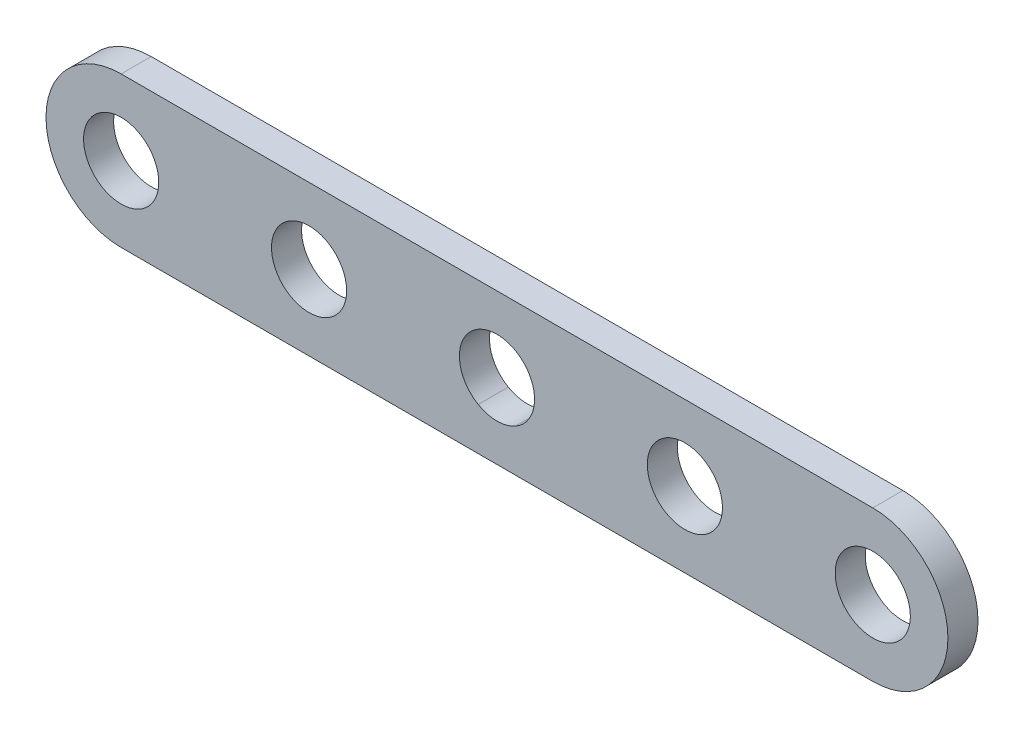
ISO-10303-21;
HEADER;
FILE_DESCRIPTION(('STEP AP214'),'2;1');
FILE_NAME('part.step','',(''),(''),'','','');
FILE_SCHEMA(('AUTOMOTIVE_DESIGN { 1 0 10303 214 1 1 1 1 }'));
ENDSEC;
DATA;
#1=APPLICATION_CONTEXT('core data for automotive mechanical design processes');
#2=APPLICATION_PROTOCOL_DEFINITION('international standard','automotive_design',2000,#1);
#3=PRODUCT_CONTEXT('',#1,'mechanical');
#4=PRODUCT('Part','Part','',(#3));
#5=PRODUCT_RELATED_PRODUCT_CATEGORY('part','',(#4));
#6=PRODUCT_DEFINITION_FORMATION('','',#4);
#7=PRODUCT_DEFINITION_CONTEXT('part definition',#1,'design');
#8=PRODUCT_DEFINITION('design','',#6,#7);
#9=PRODUCT_DEFINITION_SHAPE('','',#8);
#10=(LENGTH_UNIT() NAMED_UNIT(*) SI_UNIT(.MILLI.,.METRE.));
#11=(NAMED_UNIT(*) PLANE_ANGLE_UNIT() SI_UNIT($,.RADIAN.));
#12=(NAMED_UNIT(*) SI_UNIT($,.STERADIAN.) SOLID_ANGLE_UNIT());
#13=UNCERTAINTY_MEASURE_WITH_UNIT(LENGTH_MEASURE(1.E-05),#10,'distance_accuracy_value','');
#14=(GEOMETRIC_REPRESENTATION_CONTEXT(3) GLOBAL_UNCERTAINTY_ASSIGNED_CONTEXT((#13)) GLOBAL_UNIT_ASSIGNED_CONTEXT((#10,
#11,#12)) REPRESENTATION_CONTEXT('',''));
#15=CARTESIAN_POINT('',(0.,0.,0.));
#16=DIRECTION('',(0.,0.,1.));
#17=DIRECTION('',(1.,0.,0.));
#18=AXIS2_PLACEMENT_3D('',#15,#16,#17);
#19=CARTESIAN_POINT('',(250.,50.,0.));
#20=DIRECTION('',(0.,0.,1.));
#21=DIRECTION('',(1.,0.,0.));
#22=AXIS2_PLACEMENT_3D('',#19,#20,#21);
#23=CYLINDRICAL_SURFACE('',#22,25.);
#24=DIRECTION('',(0.,0.,1.));
#25=VECTOR('',#24,1.);
#26=CARTESIAN_POINT('',(262.5,28.349364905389,0.));
#27=LINE('',#26,#25);
#28=CARTESIAN_POINT('',(262.5,28.349364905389,20.));
#29=VERTEX_POINT('',#28);
#30=CARTESIAN_POINT('',(262.5,28.349364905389,0.));
#31=VERTEX_POINT('',#30);
#32=EDGE_CURVE('E11',#29,#31,#27,.F.);
#33=ORIENTED_EDGE('',*,*,#32,.F.);
#34=CARTESIAN_POINT('',(250.,50.,20.));
#35=DIRECTION('',(0.,0.,1.));
#36=DIRECTION('',(1.,0.,0.));
#37=AXIS2_PLACEMENT_3D('',#34,#35,#36);
#38=CIRCLE('',#37,25.);
#39=CARTESIAN_POINT('',(262.5,71.650635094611,20.));
#40=VERTEX_POINT('',#39);
#41=EDGE_CURVE('E161',#29,#40,#38,.T.);
#42=ORIENTED_EDGE('',*,*,#41,.T.);
#43=DIRECTION('',(0.,0.,1.));
#44=VECTOR('',#43,1.);
#45=CARTESIAN_POINT('',(262.5,71.650635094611,0.));
#46=LINE('',#45,#44);
#47=CARTESIAN_POINT('',(262.5,71.650635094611,0.));
#48=VERTEX_POINT('',#47);
#49=EDGE_CURVE('E43',#48,#40,#46,.T.);
#50=ORIENTED_EDGE('',*,*,#49,.F.);
#51=CARTESIAN_POINT('',(250.,50.,0.));
#52=DIRECTION('',(0.,0.,1.));
#53=DIRECTION('',(1.,0.,0.));
#54=AXIS2_PLACEMENT_3D('',#51,#52,#53);
#55=CIRCLE('',#54,25.);
#56=EDGE_CURVE('E171',#31,#48,#55,.T.);
#57=ORIENTED_EDGE('',*,*,#56,.F.);
#58=EDGE_LOOP('',(#33,#42,#50,#57));
#59=FACE_BOUND('',#58,.T.);
#60=ADVANCED_FACE('F34',(#59),#23,.F.);
#61=CARTESIAN_POINT('',(237.5,28.349364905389,20.));
#62=VERTEX_POINT('',#61);
#63=EDGE_CURVE('E163',#62,#29,#38,.T.);
#64=ORIENTED_EDGE('',*,*,#63,.T.);
#65=ORIENTED_EDGE('',*,*,#32,.T.);
#66=CARTESIAN_POINT('',(237.5,28.349364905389,0.));
#67=VERTEX_POINT('',#66);
#68=EDGE_CURVE('E172',#67,#31,#55,.T.);
#69=ORIENTED_EDGE('',*,*,#68,.F.);
#70=DIRECTION('',(0.,0.,1.));
#71=VECTOR('',#70,1.);
#72=CARTESIAN_POINT('',(237.5,28.349364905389,0.));
#73=LINE('',#72,#71);
#74=EDGE_CURVE('E56',#67,#62,#73,.T.);
#75=ORIENTED_EDGE('',*,*,#74,.T.);
#76=EDGE_LOOP('',(#64,#65,#69,#75));
#77=FACE_BOUND('',#76,.T.);
#78=ADVANCED_FACE('F207',(#77),#23,.F.);
#79=DIRECTION('',(0.,0.,1.));
#80=VECTOR('',#79,1.);
#81=CARTESIAN_POINT('',(237.5,71.650635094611,0.));
#82=LINE('',#81,#80);
#83=CARTESIAN_POINT('',(237.5,71.650635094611,20.));
#84=VERTEX_POINT('',#83);
#85=CARTESIAN_POINT('',(237.5,71.650635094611,0.));
#86=VERTEX_POINT('',#85);
#87=EDGE_CURVE('E147',#84,#86,#82,.F.);
#88=ORIENTED_EDGE('',*,*,#87,.F.);
#89=EDGE_CURVE('E170',#84,#62,#38,.T.);
#90=ORIENTED_EDGE('',*,*,#89,.T.);
#91=ORIENTED_EDGE('',*,*,#74,.F.);
#92=EDGE_CURVE('E178',#86,#67,#55,.T.);
#93=ORIENTED_EDGE('',*,*,#92,.F.);
#94=EDGE_LOOP('',(#88,#90,#91,#93));
#95=FACE_BOUND('',#94,.T.);
#96=ADVANCED_FACE('F212',(#95),#23,.F.);
#97=CARTESIAN_POINT('',(0.,50.,20.));
#98=DIRECTION('',(0.,0.,-1.));
#99=DIRECTION('',(-1.,0.,0.));
#100=AXIS2_PLACEMENT_3D('',#97,#98,#99);
#101=CYLINDRICAL_SURFACE('',#100,50.);
#102=CARTESIAN_POINT('',(0.,50.,0.));
#103=DIRECTION('',(0.,0.,1.));
#104=DIRECTION('',(1.,0.,0.));
#105=AXIS2_PLACEMENT_3D('',#102,#103,#104);
#106=CIRCLE('',#105,50.);
#107=CARTESIAN_POINT('',(0.,100.,0.));
#108=VERTEX_POINT('',#107);
#109=CARTESIAN_POINT('',(0.,0.,0.));
#110=VERTEX_POINT('',#109);
#111=EDGE_CURVE('E105',#108,#110,#106,.T.);
#112=ORIENTED_EDGE('',*,*,#111,.T.);
#113=DIRECTION('',(0.,0.,-1.));
#114=VECTOR('',#113,1.);
#115=CARTESIAN_POINT('',(0.,0.,20.));
#116=LINE('',#115,#114);
#117=CARTESIAN_POINT('',(0.,0.,20.));
#118=VERTEX_POINT('',#117);
#119=EDGE_CURVE('E112',#118,#110,#116,.T.);
#120=ORIENTED_EDGE('',*,*,#119,.F.);
#121=CARTESIAN_POINT('',(0.,50.,20.));
#122=DIRECTION('',(0.,0.,1.));
#123=DIRECTION('',(1.,0.,0.));
#124=AXIS2_PLACEMENT_3D('',#121,#122,#123);
#125=CIRCLE('',#124,50.);
#126=CARTESIAN_POINT('',(0.,100.,20.));
#127=VERTEX_POINT('',#126);
#128=EDGE_CURVE('E133',#127,#118,#125,.T.);
#129=ORIENTED_EDGE('',*,*,#128,.F.);
#130=DIRECTION('',(0.,0.,-1.));
#131=VECTOR('',#130,1.);
#132=CARTESIAN_POINT('',(0.,100.,20.));
#133=LINE('',#132,#131);
#134=EDGE_CURVE('E122',#127,#108,#133,.T.);
#135=ORIENTED_EDGE('',*,*,#134,.T.);
#136=EDGE_LOOP('',(#112,#120,#129,#135));
#137=FACE_BOUND('',#136,.T.);
#138=ADVANCED_FACE('F36',(#137),#101,.T.);
#139=CARTESIAN_POINT('',(0.,0.,20.));
#140=DIRECTION('',(0.,1.,0.));
#141=DIRECTION('',(0.,0.,1.));
#142=AXIS2_PLACEMENT_3D('',#139,#140,#141);
#143=PLANE('',#142);
#144=DIRECTION('',(1.,0.,0.));
#145=VECTOR('',#144,1.);
#146=CARTESIAN_POINT('',(0.,0.,0.));
#147=LINE('',#146,#145);
#148=CARTESIAN_POINT('',(500.,0.,0.));
#149=VERTEX_POINT('',#148);
#150=EDGE_CURVE('E100',#110,#149,#147,.T.);
#151=ORIENTED_EDGE('',*,*,#150,.T.);
#152=DIRECTION('',(0.,0.,-1.));
#153=VECTOR('',#152,1.);
#154=CARTESIAN_POINT('',(500.,0.,20.));
#155=LINE('',#154,#153);
#156=CARTESIAN_POINT('',(500.,0.,20.));
#157=VERTEX_POINT('',#156);
#158=EDGE_CURVE('E118',#157,#149,#155,.T.);
#159=ORIENTED_EDGE('',*,*,#158,.F.);
#160=DIRECTION('',(1.,0.,0.));
#161=VECTOR('',#160,1.);
#162=CARTESIAN_POINT('',(0.,0.,20.));
#163=LINE('',#162,#161);
#164=EDGE_CURVE('E114',#118,#157,#163,.T.);
#165=ORIENTED_EDGE('',*,*,#164,.F.);
#166=ORIENTED_EDGE('',*,*,#119,.T.);
#167=EDGE_LOOP('',(#151,#159,#165,#166));
#168=FACE_BOUND('',#167,.T.);
#169=ADVANCED_FACE('F113',(#168),#143,.F.);
#170=CARTESIAN_POINT('',(500.,50.,20.));
#171=DIRECTION('',(0.,0.,-1.));
#172=DIRECTION('',(-1.,0.,0.));
#173=AXIS2_PLACEMENT_3D('',#170,#171,#172);
#174=CYLINDRICAL_SURFACE('',#173,50.);
#175=CARTESIAN_POINT('',(500.,50.,0.));
#176=DIRECTION('',(0.,0.,1.));
#177=DIRECTION('',(-1.,0.,0.));
#178=AXIS2_PLACEMENT_3D('',#175,#176,#177);
#179=CIRCLE('',#178,50.);
#180=CARTESIAN_POINT('',(500.,100.,0.));
#181=VERTEX_POINT('',#180);
#182=EDGE_CURVE('E106',#149,#181,#179,.T.);
#183=ORIENTED_EDGE('',*,*,#182,.T.);
#184=DIRECTION('',(0.,0.,-1.));
#185=VECTOR('',#184,1.);
#186=CARTESIAN_POINT('',(500.,100.,20.));
#187=LINE('',#186,#185);
#188=CARTESIAN_POINT('',(500.,100.,20.));
#189=VERTEX_POINT('',#188);
#190=EDGE_CURVE('E141',#189,#181,#187,.T.);
#191=ORIENTED_EDGE('',*,*,#190,.F.);
#192=CARTESIAN_POINT('',(500.,50.,20.));
#193=DIRECTION('',(0.,0.,1.));
#194=DIRECTION('',(-1.,0.,0.));
#195=AXIS2_PLACEMENT_3D('',#192,#193,#194);
#196=CIRCLE('',#195,50.);
#197=EDGE_CURVE('E136',#157,#189,#196,.T.);
#198=ORIENTED_EDGE('',*,*,#197,.F.);
#199=ORIENTED_EDGE('',*,*,#158,.T.);
#200=EDGE_LOOP('',(#183,#191,#198,#199));
#201=FACE_BOUND('',#200,.T.);
#202=ADVANCED_FACE('F198',(#201),#174,.T.);
#203=CARTESIAN_POINT('',(0.,100.,20.));
#204=DIRECTION('',(0.,-1.,0.));
#205=DIRECTION('',(0.,0.,-1.));
#206=AXIS2_PLACEMENT_3D('',#203,#204,#205);
#207=PLANE('',#206);
#208=DIRECTION('',(-1.,0.,0.));
#209=VECTOR('',#208,1.);
#210=CARTESIAN_POINT('',(0.,100.,0.));
#211=LINE('',#210,#209);
#212=EDGE_CURVE('E131',#181,#108,#211,.T.);
#213=ORIENTED_EDGE('',*,*,#212,.T.);
#214=ORIENTED_EDGE('',*,*,#134,.F.);
#215=DIRECTION('',(-1.,0.,0.));
#216=VECTOR('',#215,1.);
#217=CARTESIAN_POINT('',(0.,100.,20.));
#218=LINE('',#217,#216);
#219=EDGE_CURVE('E138',#189,#127,#218,.T.);
#220=ORIENTED_EDGE('',*,*,#219,.F.);
#221=ORIENTED_EDGE('',*,*,#190,.T.);
#222=EDGE_LOOP('',(#213,#214,#220,#221));
#223=FACE_BOUND('',#222,.T.);
#224=ADVANCED_FACE('F190',(#223),#207,.F.);
#225=CARTESIAN_POINT('',(0.,50.,20.));
#226=DIRECTION('',(0.,0.,1.));
#227=DIRECTION('',(1.,0.,0.));
#228=AXIS2_PLACEMENT_3D('',#225,#226,#227);
#229=PLANE('',#228);
#230=CARTESIAN_POINT('',(500.,50.,20.));
#231=DIRECTION('',(0.,0.,1.));
#232=DIRECTION('',(1.,0.,0.));
#233=AXIS2_PLACEMENT_3D('',#230,#231,#232);
#234=CIRCLE('',#233,25.);
#235=CARTESIAN_POINT('',(525.,50.,20.));
#236=VERTEX_POINT('',#235);
#237=EDGE_CURVE('E329',#236,#236,#234,.T.);
#238=ORIENTED_EDGE('',*,*,#237,.F.);
#239=EDGE_LOOP('',(#238));
#240=FACE_BOUND('',#239,.T.);
#241=CARTESIAN_POINT('',(375.,50.,20.));
#242=DIRECTION('',(0.,0.,1.));
#243=DIRECTION('',(1.,0.,0.));
#244=AXIS2_PLACEMENT_3D('',#241,#242,#243);
#245=CIRCLE('',#244,25.);
#246=CARTESIAN_POINT('',(400.,50.,20.));
#247=VERTEX_POINT('',#246);
#248=EDGE_CURVE('E331',#247,#247,#245,.T.);
#249=ORIENTED_EDGE('',*,*,#248,.F.);
#250=EDGE_LOOP('',(#249));
#251=FACE_BOUND('',#250,.T.);
#252=EDGE_CURVE('E157',#40,#84,#38,.T.);
#253=ORIENTED_EDGE('',*,*,#252,.F.);
#254=ORIENTED_EDGE('',*,*,#41,.F.);
#255=ORIENTED_EDGE('',*,*,#63,.F.);
#256=ORIENTED_EDGE('',*,*,#89,.F.);
#257=EDGE_LOOP('',(#253,#254,#255,#256));
#258=FACE_BOUND('',#257,.T.);
#259=CARTESIAN_POINT('',(125.,50.,20.));
#260=DIRECTION('',(0.,0.,1.));
#261=DIRECTION('',(1.,0.,0.));
#262=AXIS2_PLACEMENT_3D('',#259,#260,#261);
#263=CIRCLE('',#262,25.);
#264=CARTESIAN_POINT('',(150.,50.,20.));
#265=VERTEX_POINT('',#264);
#266=EDGE_CURVE('E177',#265,#265,#263,.T.);
#267=ORIENTED_EDGE('',*,*,#266,.F.);
#268=EDGE_LOOP('',(#267));
#269=FACE_BOUND('',#268,.T.);
#270=CARTESIAN_POINT('',(0.,50.,20.));
#271=DIRECTION('',(0.,0.,1.));
#272=DIRECTION('',(1.,0.,0.));
#273=AXIS2_PLACEMENT_3D('',#270,#271,#272);
#274=CIRCLE('',#273,25.);
#275=CARTESIAN_POINT('',(25.,50.,20.));
#276=VERTEX_POINT('',#275);
#277=EDGE_CURVE('E126',#276,#276,#274,.T.);
#278=ORIENTED_EDGE('',*,*,#277,.F.);
#279=EDGE_LOOP('',(#278));
#280=FACE_BOUND('',#279,.T.);
#281=ORIENTED_EDGE('',*,*,#128,.T.);
#282=ORIENTED_EDGE('',*,*,#164,.T.);
#283=ORIENTED_EDGE('',*,*,#197,.T.);
#284=ORIENTED_EDGE('',*,*,#219,.T.);
#285=EDGE_LOOP('',(#281,#282,#283,#284));
#286=FACE_BOUND('',#285,.T.);
#287=ADVANCED_FACE('F167',(#240,#251,#258,#269,#280,#286),#229,.T.);
#288=CARTESIAN_POINT('',(0.,50.,0.));
#289=DIRECTION('',(0.,0.,1.));
#290=DIRECTION('',(1.,0.,0.));
#291=AXIS2_PLACEMENT_3D('',#288,#289,#290);
#292=PLANE('',#291);
#293=CARTESIAN_POINT('',(500.,50.,0.));
#294=DIRECTION('',(0.,0.,1.));
#295=DIRECTION('',(1.,0.,0.));
#296=AXIS2_PLACEMENT_3D('',#293,#294,#295);
#297=CIRCLE('',#296,25.);
#298=CARTESIAN_POINT('',(525.,50.,0.));
#299=VERTEX_POINT('',#298);
#300=EDGE_CURVE('E326',#299,#299,#297,.T.);
#301=ORIENTED_EDGE('',*,*,#300,.T.);
#302=EDGE_LOOP('',(#301));
#303=FACE_BOUND('',#302,.T.);
#304=CARTESIAN_POINT('',(375.,50.,0.));
#305=DIRECTION('',(0.,0.,1.));
#306=DIRECTION('',(1.,0.,0.));
#307=AXIS2_PLACEMENT_3D('',#304,#305,#306);
#308=CIRCLE('',#307,25.);
#309=CARTESIAN_POINT('',(400.,50.,0.));
#310=VERTEX_POINT('',#309);
#311=EDGE_CURVE('E164',#310,#310,#308,.T.);
#312=ORIENTED_EDGE('',*,*,#311,.T.);
#313=EDGE_LOOP('',(#312));
#314=FACE_BOUND('',#313,.T.);
#315=EDGE_CURVE('E159',#48,#86,#55,.T.);
#316=ORIENTED_EDGE('',*,*,#315,.T.);
#317=ORIENTED_EDGE('',*,*,#92,.T.);
#318=ORIENTED_EDGE('',*,*,#68,.T.);
#319=ORIENTED_EDGE('',*,*,#56,.T.);
#320=EDGE_LOOP('',(#316,#317,#318,#319));
#321=FACE_BOUND('',#320,.T.);
#322=CARTESIAN_POINT('',(125.,50.,0.));
#323=DIRECTION('',(0.,0.,1.));
#324=DIRECTION('',(1.,0.,0.));
#325=AXIS2_PLACEMENT_3D('',#322,#323,#324);
#326=CIRCLE('',#325,25.);
#327=CARTESIAN_POINT('',(150.,50.,0.));
#328=VERTEX_POINT('',#327);
#329=EDGE_CURVE('E181',#328,#328,#326,.T.);
#330=ORIENTED_EDGE('',*,*,#329,.T.);
#331=EDGE_LOOP('',(#330));
#332=FACE_BOUND('',#331,.T.);
#333=CARTESIAN_POINT('',(0.,50.,0.));
#334=DIRECTION('',(0.,0.,1.));
#335=DIRECTION('',(1.,0.,0.));
#336=AXIS2_PLACEMENT_3D('',#333,#334,#335);
#337=CIRCLE('',#336,25.);
#338=CARTESIAN_POINT('',(25.,50.,0.));
#339=VERTEX_POINT('',#338);
#340=EDGE_CURVE('E123',#339,#339,#337,.T.);
#341=ORIENTED_EDGE('',*,*,#340,.T.);
#342=EDGE_LOOP('',(#341));
#343=FACE_BOUND('',#342,.T.);
#344=ORIENTED_EDGE('',*,*,#111,.F.);
#345=ORIENTED_EDGE('',*,*,#212,.F.);
#346=ORIENTED_EDGE('',*,*,#182,.F.);
#347=ORIENTED_EDGE('',*,*,#150,.F.);
#348=EDGE_LOOP('',(#344,#345,#346,#347));
#349=FACE_BOUND('',#348,.T.);
#350=ADVANCED_FACE('F102',(#303,#314,#321,#332,#343,#349),#292,.F.);
#351=CARTESIAN_POINT('',(0.,50.,0.));
#352=DIRECTION('',(0.,0.,1.));
#353=DIRECTION('',(1.,0.,0.));
#354=AXIS2_PLACEMENT_3D('',#351,#352,#353);
#355=CYLINDRICAL_SURFACE('',#354,25.);
#356=ORIENTED_EDGE('',*,*,#340,.F.);
#357=EDGE_LOOP('',(#356));
#358=FACE_BOUND('',#357,.T.);
#359=ORIENTED_EDGE('',*,*,#277,.T.);
#360=EDGE_LOOP('',(#359));
#361=FACE_BOUND('',#360,.T.);
#362=ADVANCED_FACE('F186',(#358,#361),#355,.F.);
#363=CARTESIAN_POINT('',(125.,50.,0.));
#364=DIRECTION('',(0.,0.,1.));
#365=DIRECTION('',(1.,0.,0.));
#366=AXIS2_PLACEMENT_3D('',#363,#364,#365);
#367=CYLINDRICAL_SURFACE('',#366,25.);
#368=ORIENTED_EDGE('',*,*,#329,.F.);
#369=EDGE_LOOP('',(#368));
#370=FACE_BOUND('',#369,.T.);
#371=ORIENTED_EDGE('',*,*,#266,.T.);
#372=EDGE_LOOP('',(#371));
#373=FACE_BOUND('',#372,.T.);
#374=ADVANCED_FACE('F217',(#370,#373),#367,.F.);
#375=ORIENTED_EDGE('',*,*,#315,.F.);
#376=ORIENTED_EDGE('',*,*,#49,.T.);
#377=ORIENTED_EDGE('',*,*,#252,.T.);
#378=ORIENTED_EDGE('',*,*,#87,.T.);
#379=EDGE_LOOP('',(#375,#376,#377,#378));
#380=FACE_BOUND('',#379,.T.);
#381=ADVANCED_FACE('F155',(#380),#23,.F.);
#382=CARTESIAN_POINT('',(375.,50.,0.));
#383=DIRECTION('',(0.,0.,1.));
#384=DIRECTION('',(1.,0.,0.));
#385=AXIS2_PLACEMENT_3D('',#382,#383,#384);
#386=CYLINDRICAL_SURFACE('',#385,25.);
#387=ORIENTED_EDGE('',*,*,#311,.F.);
#388=EDGE_LOOP('',(#387));
#389=FACE_BOUND('',#388,.T.);
#390=ORIENTED_EDGE('',*,*,#248,.T.);
#391=EDGE_LOOP('',(#390));
#392=FACE_BOUND('',#391,.T.);
#393=ADVANCED_FACE('F216',(#389,#392),#386,.F.);
#394=CARTESIAN_POINT('',(500.,50.,0.));
#395=DIRECTION('',(0.,0.,1.));
#396=DIRECTION('',(1.,0.,0.));
#397=AXIS2_PLACEMENT_3D('',#394,#395,#396);
#398=CYLINDRICAL_SURFACE('',#397,25.);
#399=ORIENTED_EDGE('',*,*,#300,.F.);
#400=EDGE_LOOP('',(#399));
#401=FACE_BOUND('',#400,.T.);
#402=ORIENTED_EDGE('',*,*,#237,.T.);
#403=EDGE_LOOP('',(#402));
#404=FACE_BOUND('',#403,.T.);
#405=ADVANCED_FACE('F222',(#401,#404),#398,.F.);
#406=CLOSED_SHELL('',(#60,#78,#96,#138,#169,#202,#224,#287,#350,#362,#374,#381,#393,#405));
#407=MANIFOLD_SOLID_BREP('B2',#406);
#408=ADVANCED_BREP_SHAPE_REPRESENTATION('',(#18,#407),#14);
#409=SHAPE_DEFINITION_REPRESENTATION(#9,#408);
ENDSEC;
END-ISO-10303-21;
